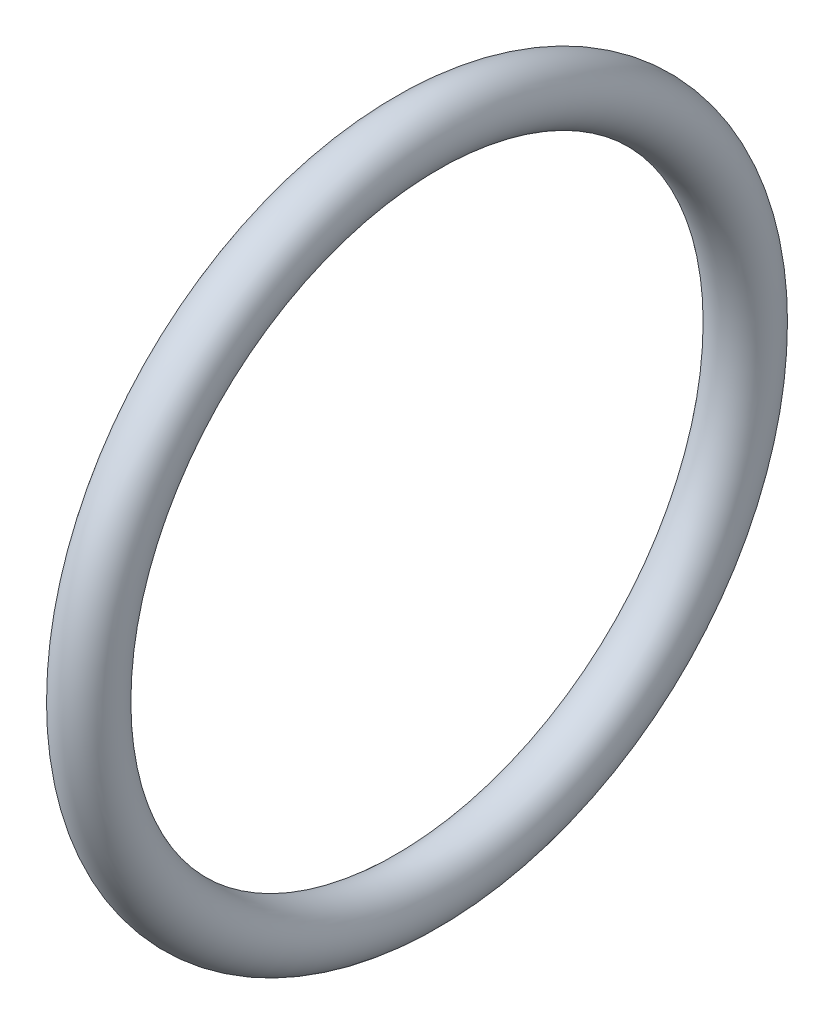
from build123d import *

# Parameters (mm, degrees)
ESQUISSE1_R = 0.5


with BuildPart() as part:
    # Esquisse1 → Base-R_volution (revolve)
    with BuildSketch(Plane.XY, mode=Mode.PRIVATE) as base_r_volution_sk:
        with Locations((0, 5.5)):
            Circle(ESQUISSE1_R)
    revolve(base_r_volution_sk.sketch.rotate(Axis((-4.768875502, 0, 0), (1, 0, 0)), 90), axis=Axis((-4.768875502, 0, 0), (1, 0, 0)))


solid = part.part
